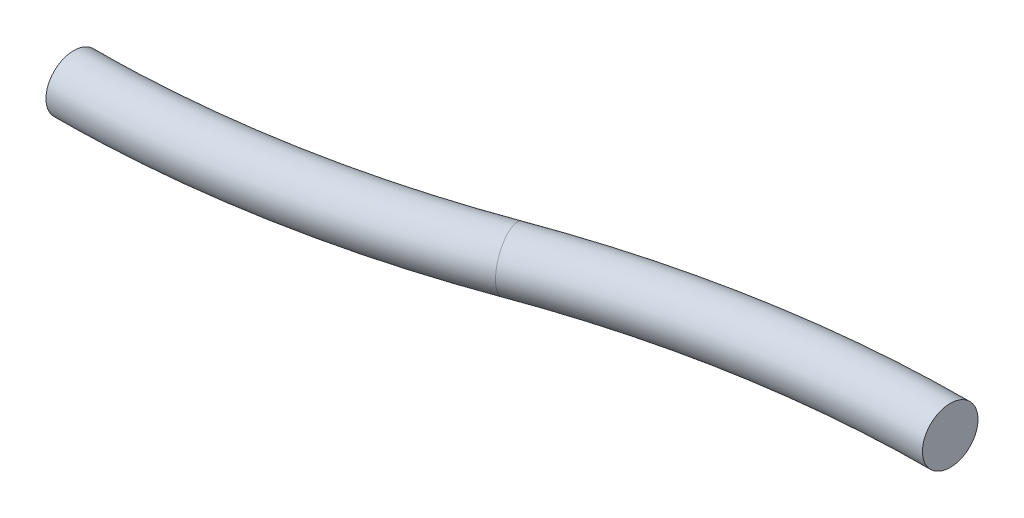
from build123d import *

# Parameters (mm, degrees)
SKETCH2_R = 4.7625


with BuildPart() as part:
    # Sweep1: sweep along a path in Sketch1
    with BuildLine(Plane(origin=(0, 0, 0), x_dir=(1, 0, 0), z_dir=(0, 1, 0))) as sweep1_path:
        ThreePointArc((0, 0), (32.380218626, 2.865478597), (63.754, 11.37285))
        ThreePointArc((63.754, 11.37285), (95.127781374, 19.880221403), (127.508, 22.7457))
    # Sketch2 → Sweep1 (sweep)
    with BuildSketch(Plane(origin=(0, 0, 0), x_dir=(0, 0, -1), z_dir=(1, 0, 0))):
        Circle(SKETCH2_R)
    sweep(path=sweep1_path.line)


solid = part.part
